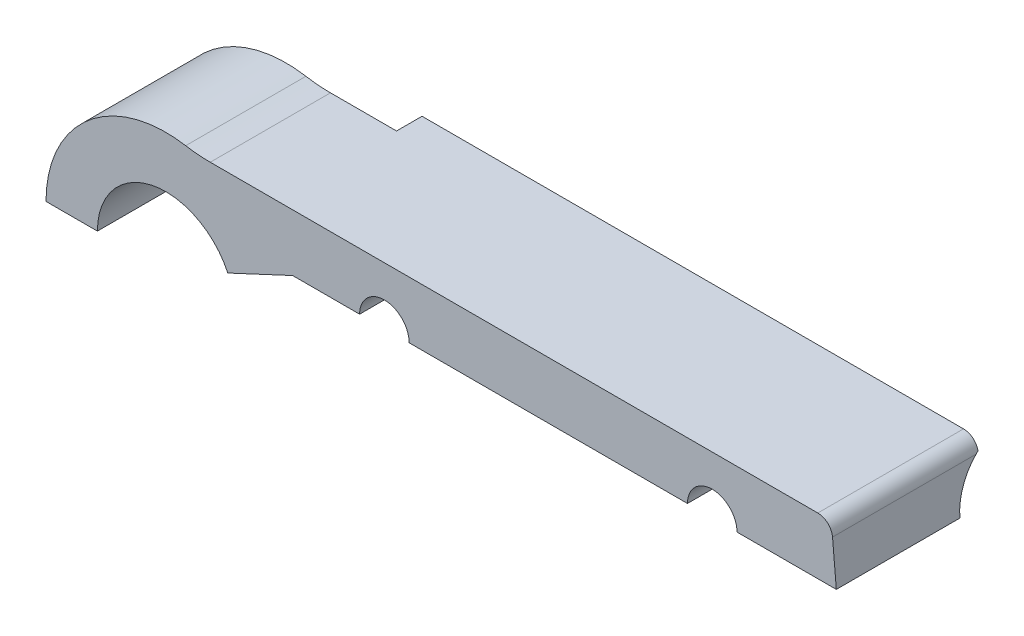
from build123d import *

# Parameters (mm, degrees)
BASE_EXTRUSION_DEPTH         = 20
ESQUISSE3_R                  = 22
ENL_V_MAT_EXTRU_1_DEPTH      = 3.5
ESQUISSE4_R                  = 7.815
ENL_V_MAT_EXTRU_2_DEPTH      = 115.413399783
ESQUISSE5_R                  = 9.39
ENL_V_MAT_EXTRU_3_DEPTH      = 95.936264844
TROU_TARAUD_M8X1_252_D       = 6.8
ENL_V_MAT_EXTRU_4_DEPTH      = 95.936264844
ENL_V_MAT_EXTRU_4_DEPTH_BACK = 95.936264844


with BuildPart() as part:
    # Esquisse1 → Base-Extrusion (new body)
    with BuildSketch(Plane.XY):
        with BuildLine():
            Line((6.100803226, 15.935), (89.489847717, 15.935))
            ThreePointArc((89.489847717, 15.935), (90.861295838, 15.401672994), (91.512122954, 14.081926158))
            Line((91.512122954, 14.081926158), (92.033723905, 8.12))
            Line((92.033723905, 8.12), (91.512122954, 2.158073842))
            ThreePointArc((91.512122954, 2.158073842), (90.861295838, 0.838327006), (89.489847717, 0.305))
            Line((89.489847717, 0.305), (30.828477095, 0.305))
            ThreePointArc((30.828477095, 0.305), (21.137014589, -2.157804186), (13.797096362, -8.948639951))
            ThreePointArc((13.797096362, -8.948639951), (-15.053690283, -6.620002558), (2.730377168, 16.216752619))
            ThreePointArc((2.730377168, 16.216752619), (4.409712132, 16.005560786), (6.100803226, 15.935))
        make_face()
    extrude(amount=BASE_EXTRUSION_DEPTH)

    # Esquisse3 → Enl_v. mat.-Extru.1 (cut)
    with BuildSketch(Plane(origin=(0, 0, 0), x_dir=(-1, 0, 0), z_dir=(0, 0, -1))):
        Circle(ESQUISSE3_R)
    extrude(amount=-ENL_V_MAT_EXTRU_1_DEPTH, mode=Mode.SUBTRACT)

    # Esquisse4 → Enl_v. mat.-Extru.2 (cut, through all)
    with BuildSketch(Plane(origin=(95, 0, 0), x_dir=(0, 0, -1), z_dir=(1, 0, 0))):
        with Locations((4.77, 8.12)):
            Circle(ESQUISSE4_R)
    extrude(amount=-ENL_V_MAT_EXTRU_2_DEPTH, mode=Mode.SUBTRACT)

    # Esquisse5 → Enl_v. mat.-Extru.3 (cut, through all)
    with BuildSketch(Plane(origin=(0, 0, 3.5), x_dir=(-1, 0, 0), z_dir=(0, 0, -1))):
        Circle(ESQUISSE5_R)
    extrude(amount=-ENL_V_MAT_EXTRU_3_DEPTH, mode=Mode.SUBTRACT)

    # Trou taraud_ M8x1.252 (through all)
    with Locations(Plane.XY.offset(20)):
        with Locations((30, 8.12), (75, 8.12)):
            Hole(TROU_TARAUD_M8X1_252_D / 2)

    # Esquisse11 → Enl_v. mat.-Extru.4 (cut, two sides: drawn at the far end of the back side and taken through both)
    with BuildSketch(Plane(origin=(0, 0, 3.5), x_dir=(-1, 0, 0), z_dir=(0, 0, -1)).offset(-ENL_V_MAT_EXTRU_4_DEPTH_BACK)):
        Polygon((260.51590694, 0), (19.628861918, 0), (0, 0), (-17.413396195, 8.12), (-96.354679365, 8.12), (-337.241724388, 8.12), (-343.785588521, -473.60964584), (253.972042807, -481.72964584), align=None)
    extrude(amount=ENL_V_MAT_EXTRU_4_DEPTH + ENL_V_MAT_EXTRU_4_DEPTH_BACK, mode=Mode.SUBTRACT)


solid = part.part
